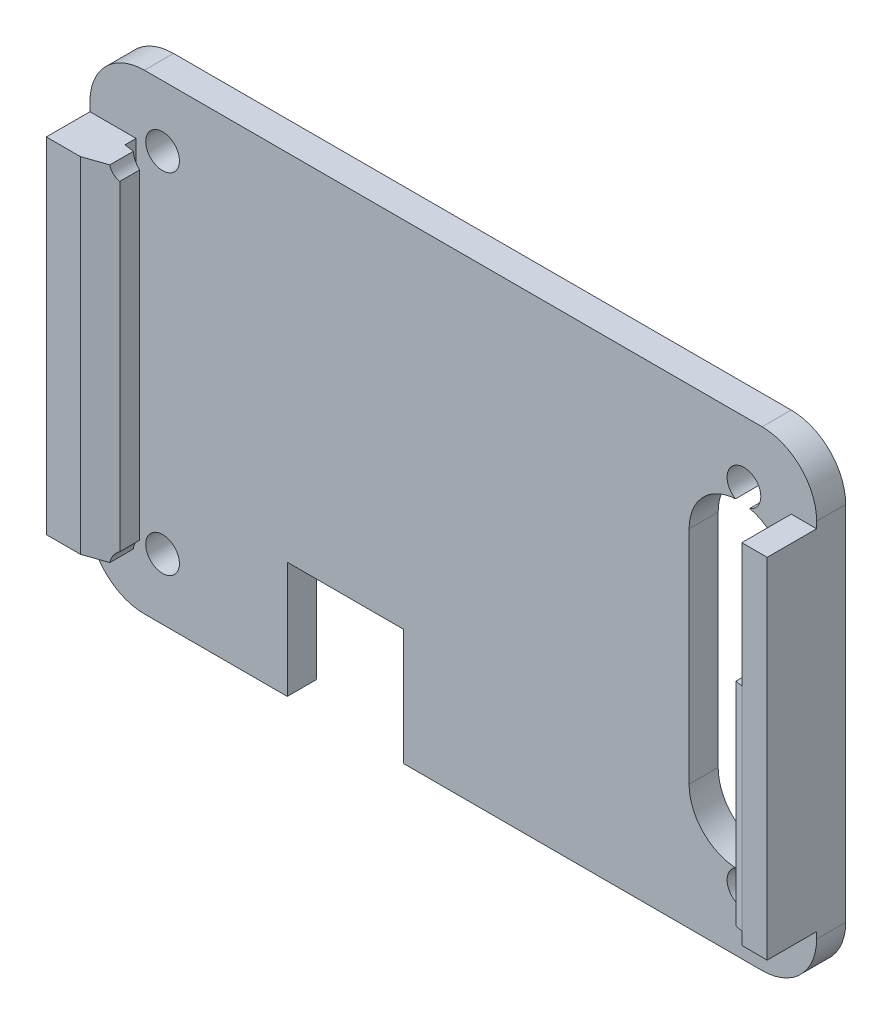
ISO-10303-21;
HEADER;
FILE_DESCRIPTION(('STEP AP214'),'2;1');
FILE_NAME('part.step','',(''),(''),'','','');
FILE_SCHEMA(('AUTOMOTIVE_DESIGN { 1 0 10303 214 1 1 1 1 }'));
ENDSEC;
DATA;
#1=APPLICATION_CONTEXT('core data for automotive mechanical design processes');
#2=APPLICATION_PROTOCOL_DEFINITION('international standard','automotive_design',2000,#1);
#3=PRODUCT_CONTEXT('',#1,'mechanical');
#4=PRODUCT('Part','Part','',(#3));
#5=PRODUCT_RELATED_PRODUCT_CATEGORY('part','',(#4));
#6=PRODUCT_DEFINITION_FORMATION('','',#4);
#7=PRODUCT_DEFINITION_CONTEXT('part definition',#1,'design');
#8=PRODUCT_DEFINITION('design','',#6,#7);
#9=PRODUCT_DEFINITION_SHAPE('','',#8);
#10=(LENGTH_UNIT() NAMED_UNIT(*) SI_UNIT(.MILLI.,.METRE.));
#11=(NAMED_UNIT(*) PLANE_ANGLE_UNIT() SI_UNIT($,.RADIAN.));
#12=(NAMED_UNIT(*) SI_UNIT($,.STERADIAN.) SOLID_ANGLE_UNIT());
#13=UNCERTAINTY_MEASURE_WITH_UNIT(LENGTH_MEASURE(1.E-05),#10,'distance_accuracy_value','');
#14=(GEOMETRIC_REPRESENTATION_CONTEXT(3) GLOBAL_UNCERTAINTY_ASSIGNED_CONTEXT((#13)) GLOBAL_UNIT_ASSIGNED_CONTEXT((#10,
#11,#12)) REPRESENTATION_CONTEXT('',''));
#15=CARTESIAN_POINT('',(0.,0.,0.));
#16=DIRECTION('',(0.,0.,1.));
#17=DIRECTION('',(1.,0.,0.));
#18=AXIS2_PLACEMENT_3D('',#15,#16,#17);
#19=CARTESIAN_POINT('',(24.9129363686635,9.66443864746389,4.318));
#20=DIRECTION('',(0.,0.,-1.));
#21=DIRECTION('',(-1.,0.,0.));
#22=AXIS2_PLACEMENT_3D('',#19,#20,#21);
#23=CYLINDRICAL_SURFACE('',#22,4.30609592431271);
#24=CARTESIAN_POINT('',(24.9129363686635,9.66443864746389,2.54));
#25=DIRECTION('',(0.,0.,-1.));
#26=DIRECTION('',(-1.,0.,0.));
#27=AXIS2_PLACEMENT_3D('',#24,#25,#26);
#28=CIRCLE('',#27,4.30609592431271);
#29=CARTESIAN_POINT('',(25.9027333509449,13.8552338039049,2.54));
#30=VERTEX_POINT('',#29);
#31=CARTESIAN_POINT('',(29.2190322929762,9.66443864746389,2.54));
#32=VERTEX_POINT('',#31);
#33=EDGE_CURVE('E295',#30,#32,#28,.T.);
#34=ORIENTED_EDGE('',*,*,#33,.F.);
#35=DIRECTION('',(0.,0.,-1.));
#36=VECTOR('',#35,1.);
#37=CARTESIAN_POINT('',(25.9027333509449,13.8552338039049,3.429));
#38=LINE('',#37,#36);
#39=CARTESIAN_POINT('',(25.9027333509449,13.8552338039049,0.));
#40=VERTEX_POINT('',#39);
#41=EDGE_CURVE('E13',#30,#40,#38,.T.);
#42=ORIENTED_EDGE('',*,*,#41,.T.);
#43=CARTESIAN_POINT('',(24.9129363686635,9.66443864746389,0.));
#44=DIRECTION('',(0.,0.,-1.));
#45=DIRECTION('',(-1.,0.,0.));
#46=AXIS2_PLACEMENT_3D('',#43,#44,#45);
#47=CIRCLE('',#46,4.30609592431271);
#48=CARTESIAN_POINT('',(29.2190322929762,9.66443864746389,0.));
#49=VERTEX_POINT('',#48);
#50=EDGE_CURVE('E293',#40,#49,#47,.T.);
#51=ORIENTED_EDGE('',*,*,#50,.T.);
#52=DIRECTION('',(0.,0.,-1.));
#53=VECTOR('',#52,1.);
#54=CARTESIAN_POINT('',(29.2190322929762,9.66443864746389,4.318));
#55=LINE('',#54,#53);
#56=EDGE_CURVE('E318',#32,#49,#55,.T.);
#57=ORIENTED_EDGE('',*,*,#56,.F.);
#58=EDGE_LOOP('',(#34,#42,#51,#57));
#59=FACE_BOUND('',#58,.T.);
#60=ADVANCED_FACE('F46',(#59),#23,.F.);
#61=CARTESIAN_POINT('',(24.9129363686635,-9.66443864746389,4.318));
#62=DIRECTION('',(0.,0.,-1.));
#63=DIRECTION('',(-1.,0.,0.));
#64=AXIS2_PLACEMENT_3D('',#61,#62,#63);
#65=CYLINDRICAL_SURFACE('',#64,4.30609592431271);
#66=CARTESIAN_POINT('',(24.9129363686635,-9.66443864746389,2.54));
#67=DIRECTION('',(0.,0.,-1.));
#68=DIRECTION('',(-1.,0.,0.));
#69=AXIS2_PLACEMENT_3D('',#66,#67,#68);
#70=CIRCLE('',#69,4.30609592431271);
#71=CARTESIAN_POINT('',(24.6647760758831,-13.9633778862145,2.54));
#72=VERTEX_POINT('',#71);
#73=CARTESIAN_POINT('',(20.6068404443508,-9.66443864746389,2.54));
#74=VERTEX_POINT('',#73);
#75=EDGE_CURVE('E330',#72,#74,#70,.T.);
#76=ORIENTED_EDGE('',*,*,#75,.F.);
#77=DIRECTION('',(0.,0.,-1.));
#78=VECTOR('',#77,1.);
#79=CARTESIAN_POINT('',(24.6647760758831,-13.9633778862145,3.429));
#80=LINE('',#79,#78);
#81=CARTESIAN_POINT('',(24.6647760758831,-13.9633778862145,0.));
#82=VERTEX_POINT('',#81);
#83=EDGE_CURVE('E465',#72,#82,#80,.T.);
#84=ORIENTED_EDGE('',*,*,#83,.T.);
#85=CARTESIAN_POINT('',(24.9129363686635,-9.66443864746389,0.));
#86=DIRECTION('',(0.,0.,-1.));
#87=DIRECTION('',(-1.,0.,0.));
#88=AXIS2_PLACEMENT_3D('',#85,#86,#87);
#89=CIRCLE('',#88,4.30609592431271);
#90=CARTESIAN_POINT('',(20.6068404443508,-9.66443864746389,0.));
#91=VERTEX_POINT('',#90);
#92=EDGE_CURVE('E311',#82,#91,#89,.T.);
#93=ORIENTED_EDGE('',*,*,#92,.T.);
#94=DIRECTION('',(0.,0.,-1.));
#95=VECTOR('',#94,1.);
#96=CARTESIAN_POINT('',(20.6068404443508,-9.66443864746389,4.318));
#97=LINE('',#96,#95);
#98=EDGE_CURVE('E322',#74,#91,#97,.T.);
#99=ORIENTED_EDGE('',*,*,#98,.F.);
#100=EDGE_LOOP('',(#76,#84,#93,#99));
#101=FACE_BOUND('',#100,.T.);
#102=ADVANCED_FACE('F486',(#101),#65,.F.);
#103=CARTESIAN_POINT('',(0.,0.,2.54));
#104=DIRECTION('',(0.,0.,-1.));
#105=DIRECTION('',(-1.,0.,0.));
#106=AXIS2_PLACEMENT_3D('',#103,#104,#105);
#107=PLANE('',#106);
#108=CARTESIAN_POINT('',(-25.4,-15.24,2.54));
#109=DIRECTION('',(0.,0.,-1.));
#110=DIRECTION('',(-1.,0.,0.));
#111=AXIS2_PLACEMENT_3D('',#108,#109,#110);
#112=CIRCLE('',#111,1.47319999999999);
#113=CARTESIAN_POINT('',(-26.8732,-15.24,2.54));
#114=VERTEX_POINT('',#113);
#115=EDGE_CURVE('E468',#114,#114,#112,.T.);
#116=ORIENTED_EDGE('',*,*,#115,.T.);
#117=EDGE_LOOP('',(#116));
#118=FACE_BOUND('',#117,.T.);
#119=CARTESIAN_POINT('',(-25.4,15.24,2.54));
#120=DIRECTION('',(0.,0.,-1.));
#121=DIRECTION('',(-1.,0.,0.));
#122=AXIS2_PLACEMENT_3D('',#119,#120,#121);
#123=CIRCLE('',#122,1.47319999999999);
#124=CARTESIAN_POINT('',(-26.8732,15.24,2.54));
#125=VERTEX_POINT('',#124);
#126=EDGE_CURVE('E458',#125,#125,#123,.T.);
#127=ORIENTED_EDGE('',*,*,#126,.T.);
#128=EDGE_LOOP('',(#127));
#129=FACE_BOUND('',#128,.T.);
#130=CARTESIAN_POINT('',(20.6068404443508,9.66443864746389,2.54));
#131=VERTEX_POINT('',#130);
#132=CARTESIAN_POINT('',(24.6647760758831,13.9633778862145,2.54));
#133=VERTEX_POINT('',#132);
#134=EDGE_CURVE('E337',#131,#133,#28,.T.);
#135=ORIENTED_EDGE('',*,*,#134,.T.);
#136=CARTESIAN_POINT('',(25.4,15.24,2.54));
#137=DIRECTION('',(0.,0.,-1.));
#138=DIRECTION('',(-1.,0.,0.));
#139=AXIS2_PLACEMENT_3D('',#136,#137,#138);
#140=CIRCLE('',#139,1.47319999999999);
#141=EDGE_CURVE('E61',#133,#30,#140,.T.);
#142=ORIENTED_EDGE('',*,*,#141,.T.);
#143=ORIENTED_EDGE('',*,*,#33,.T.);
#144=DIRECTION('',(0.,-1.,0.));
#145=VECTOR('',#144,1.);
#146=CARTESIAN_POINT('',(29.2190322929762,0.,2.54));
#147=LINE('',#146,#145);
#148=CARTESIAN_POINT('',(29.2190322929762,-9.66443864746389,2.54));
#149=VERTEX_POINT('',#148);
#150=EDGE_CURVE('E321',#32,#149,#147,.T.);
#151=ORIENTED_EDGE('',*,*,#150,.T.);
#152=CARTESIAN_POINT('',(25.9027333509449,-13.8552338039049,2.54));
#153=VERTEX_POINT('',#152);
#154=EDGE_CURVE('E331',#149,#153,#70,.T.);
#155=ORIENTED_EDGE('',*,*,#154,.T.);
#156=CARTESIAN_POINT('',(25.4,-15.24,2.54));
#157=DIRECTION('',(0.,0.,-1.));
#158=DIRECTION('',(-1.,0.,0.));
#159=AXIS2_PLACEMENT_3D('',#156,#157,#158);
#160=CIRCLE('',#159,1.47319999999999);
#161=EDGE_CURVE('E491',#153,#72,#160,.T.);
#162=ORIENTED_EDGE('',*,*,#161,.T.);
#163=ORIENTED_EDGE('',*,*,#75,.T.);
#164=DIRECTION('',(0.,1.,0.));
#165=VECTOR('',#164,1.);
#166=CARTESIAN_POINT('',(20.6068404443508,0.,2.54));
#167=LINE('',#166,#165);
#168=EDGE_CURVE('E334',#74,#131,#167,.T.);
#169=ORIENTED_EDGE('',*,*,#168,.T.);
#170=EDGE_LOOP('',(#135,#142,#143,#151,#155,#162,#163,#169));
#171=FACE_BOUND('',#170,.T.);
#172=DIRECTION('',(1.,0.,0.));
#173=VECTOR('',#172,1.);
#174=CARTESIAN_POINT('',(31.75,-15.24,2.54));
#175=LINE('',#174,#173);
#176=CARTESIAN_POINT('',(29.5313256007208,-15.24,2.54));
#177=VERTEX_POINT('',#176);
#178=CARTESIAN_POINT('',(31.75,-15.24,2.54));
#179=VERTEX_POINT('',#178);
#180=EDGE_CURVE('E545',#177,#179,#175,.T.);
#181=ORIENTED_EDGE('',*,*,#180,.F.);
#182=DIRECTION('',(0.,-1.,0.));
#183=VECTOR('',#182,1.);
#184=CARTESIAN_POINT('',(29.5313256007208,-15.24,2.54));
#185=LINE('',#184,#183);
#186=CARTESIAN_POINT('',(29.5313256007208,15.24,2.54));
#187=VERTEX_POINT('',#186);
#188=EDGE_CURVE('E550',#187,#177,#185,.T.);
#189=ORIENTED_EDGE('',*,*,#188,.F.);
#190=DIRECTION('',(-1.,0.,0.));
#191=VECTOR('',#190,1.);
#192=CARTESIAN_POINT('',(29.5313256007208,15.24,2.54));
#193=LINE('',#192,#191);
#194=CARTESIAN_POINT('',(31.75,15.24,2.54));
#195=VERTEX_POINT('',#194);
#196=EDGE_CURVE('E561',#195,#187,#193,.T.);
#197=ORIENTED_EDGE('',*,*,#196,.F.);
#198=DIRECTION('',(0.,1.,0.));
#199=VECTOR('',#198,1.);
#200=CARTESIAN_POINT('',(31.75,-20.574,2.54));
#201=LINE('',#200,#199);
#202=CARTESIAN_POINT('',(31.75,15.8115,2.54));
#203=VERTEX_POINT('',#202);
#204=EDGE_CURVE('E578',#195,#203,#201,.T.);
#205=ORIENTED_EDGE('',*,*,#204,.T.);
#206=CARTESIAN_POINT('',(26.9875,15.8115,2.54));
#207=DIRECTION('',(0.,0.,-1.));
#208=DIRECTION('',(-1.,0.,0.));
#209=AXIS2_PLACEMENT_3D('',#206,#207,#208);
#210=CIRCLE('',#209,4.7625);
#211=CARTESIAN_POINT('',(26.9875,20.574,2.54));
#212=VERTEX_POINT('',#211);
#213=EDGE_CURVE('E433',#203,#212,#210,.F.);
#214=ORIENTED_EDGE('',*,*,#213,.T.);
#215=DIRECTION('',(-1.,0.,0.));
#216=VECTOR('',#215,1.);
#217=CARTESIAN_POINT('',(-31.75,20.574,2.54));
#218=LINE('',#217,#216);
#219=CARTESIAN_POINT('',(-26.9875,20.574,2.54));
#220=VERTEX_POINT('',#219);
#221=EDGE_CURVE('E402',#212,#220,#218,.T.);
#222=ORIENTED_EDGE('',*,*,#221,.T.);
#223=CARTESIAN_POINT('',(-26.9875,15.8115,2.54));
#224=DIRECTION('',(0.,0.,-1.));
#225=DIRECTION('',(-1.,0.,0.));
#226=AXIS2_PLACEMENT_3D('',#223,#224,#225);
#227=CIRCLE('',#226,4.7625);
#228=CARTESIAN_POINT('',(-31.75,15.8115,2.54));
#229=VERTEX_POINT('',#228);
#230=EDGE_CURVE('E431',#220,#229,#227,.F.);
#231=ORIENTED_EDGE('',*,*,#230,.T.);
#232=DIRECTION('',(0.,-1.,0.));
#233=VECTOR('',#232,1.);
#234=CARTESIAN_POINT('',(-31.75,-20.574,2.54));
#235=LINE('',#234,#233);
#236=CARTESIAN_POINT('',(-31.75,15.0495,2.54));
#237=VERTEX_POINT('',#236);
#238=EDGE_CURVE('E423',#229,#237,#235,.T.);
#239=ORIENTED_EDGE('',*,*,#238,.T.);
#240=DIRECTION('',(-1.,0.,0.));
#241=VECTOR('',#240,1.);
#242=CARTESIAN_POINT('',(-31.75,15.0495,2.54));
#243=LINE('',#242,#241);
#244=CARTESIAN_POINT('',(-27.7114,15.0495,2.54));
#245=VERTEX_POINT('',#244);
#246=EDGE_CURVE('E382',#245,#237,#243,.T.);
#247=ORIENTED_EDGE('',*,*,#246,.F.);
#248=DIRECTION('',(0.,1.,0.));
#249=VECTOR('',#248,1.);
#250=CARTESIAN_POINT('',(-27.7114,-20.574025,2.54));
#251=LINE('',#250,#249);
#252=CARTESIAN_POINT('',(-27.7114,-15.0495,2.54));
#253=VERTEX_POINT('',#252);
#254=EDGE_CURVE('E364',#253,#245,#251,.T.);
#255=ORIENTED_EDGE('',*,*,#254,.F.);
#256=DIRECTION('',(1.,0.,0.));
#257=VECTOR('',#256,1.);
#258=CARTESIAN_POINT('',(-31.75,-15.0495,2.54));
#259=LINE('',#258,#257);
#260=CARTESIAN_POINT('',(-31.75,-15.0495,2.54));
#261=VERTEX_POINT('',#260);
#262=EDGE_CURVE('E377',#261,#253,#259,.T.);
#263=ORIENTED_EDGE('',*,*,#262,.F.);
#264=CARTESIAN_POINT('',(-31.75,-15.8115,2.54));
#265=VERTEX_POINT('',#264);
#266=EDGE_CURVE('E426',#261,#265,#235,.T.);
#267=ORIENTED_EDGE('',*,*,#266,.T.);
#268=CARTESIAN_POINT('',(-26.9875,-15.8115,2.54));
#269=DIRECTION('',(0.,0.,-1.));
#270=DIRECTION('',(-1.,0.,0.));
#271=AXIS2_PLACEMENT_3D('',#268,#269,#270);
#272=CIRCLE('',#271,4.7625);
#273=CARTESIAN_POINT('',(-26.9875,-20.574,2.54));
#274=VERTEX_POINT('',#273);
#275=EDGE_CURVE('E437',#265,#274,#272,.F.);
#276=ORIENTED_EDGE('',*,*,#275,.T.);
#277=DIRECTION('',(1.,0.,0.));
#278=VECTOR('',#277,1.);
#279=CARTESIAN_POINT('',(-31.75,-20.574,2.54));
#280=LINE('',#279,#278);
#281=CARTESIAN_POINT('',(-14.5034,-20.574,2.54));
#282=VERTEX_POINT('',#281);
#283=EDGE_CURVE('E583',#274,#282,#280,.T.);
#284=ORIENTED_EDGE('',*,*,#283,.T.);
#285=DIRECTION('',(0.,-1.,0.));
#286=VECTOR('',#285,1.);
#287=CARTESIAN_POINT('',(-14.5034,-20.574,2.54));
#288=LINE('',#287,#286);
#289=CARTESIAN_POINT('',(-14.5034,-10.414,2.54));
#290=VERTEX_POINT('',#289);
#291=EDGE_CURVE('E340',#290,#282,#288,.T.);
#292=ORIENTED_EDGE('',*,*,#291,.F.);
#293=DIRECTION('',(-1.,0.,0.));
#294=VECTOR('',#293,1.);
#295=CARTESIAN_POINT('',(-14.5034,-10.414,2.54));
#296=LINE('',#295,#294);
#297=CARTESIAN_POINT('',(-4.3434,-10.414,2.54));
#298=VERTEX_POINT('',#297);
#299=EDGE_CURVE('E345',#298,#290,#296,.T.);
#300=ORIENTED_EDGE('',*,*,#299,.F.);
#301=DIRECTION('',(0.,1.,0.));
#302=VECTOR('',#301,1.);
#303=CARTESIAN_POINT('',(-4.3434,-20.574,2.54));
#304=LINE('',#303,#302);
#305=CARTESIAN_POINT('',(-4.3434,-20.574,2.54));
#306=VERTEX_POINT('',#305);
#307=EDGE_CURVE('E342',#306,#298,#304,.T.);
#308=ORIENTED_EDGE('',*,*,#307,.F.);
#309=CARTESIAN_POINT('',(26.9875,-20.574,2.54));
#310=VERTEX_POINT('',#309);
#311=EDGE_CURVE('E425',#306,#310,#280,.T.);
#312=ORIENTED_EDGE('',*,*,#311,.T.);
#313=CARTESIAN_POINT('',(26.9875,-15.8115,2.54));
#314=DIRECTION('',(0.,0.,-1.));
#315=DIRECTION('',(-1.,0.,0.));
#316=AXIS2_PLACEMENT_3D('',#313,#314,#315);
#317=CIRCLE('',#316,4.7625);
#318=CARTESIAN_POINT('',(31.75,-15.8115,2.54));
#319=VERTEX_POINT('',#318);
#320=EDGE_CURVE('E435',#310,#319,#317,.F.);
#321=ORIENTED_EDGE('',*,*,#320,.T.);
#322=EDGE_CURVE('E582',#319,#179,#201,.T.);
#323=ORIENTED_EDGE('',*,*,#322,.T.);
#324=EDGE_LOOP('',(#181,#189,#197,#205,#214,#222,#231,#239,#247,#255,#263,#267,#276,#284,#292,
#300,#308,#312,#321,#323));
#325=FACE_BOUND('',#324,.T.);
#326=ADVANCED_FACE('F476',(#118,#129,#171,#325),#107,.F.);
#327=CARTESIAN_POINT('',(-31.75,-20.574,2.54));
#328=DIRECTION('',(0.,1.,0.));
#329=DIRECTION('',(0.,0.,1.));
#330=AXIS2_PLACEMENT_3D('',#327,#328,#329);
#331=PLANE('',#330);
#332=DIRECTION('',(1.,0.,0.));
#333=VECTOR('',#332,1.);
#334=CARTESIAN_POINT('',(-31.75,-20.574,0.));
#335=LINE('',#334,#333);
#336=CARTESIAN_POINT('',(-26.9875,-20.574,0.));
#337=VERTEX_POINT('',#336);
#338=CARTESIAN_POINT('',(-14.5034,-20.574,0.));
#339=VERTEX_POINT('',#338);
#340=EDGE_CURVE('E614',#337,#339,#335,.T.);
#341=ORIENTED_EDGE('',*,*,#340,.T.);
#342=DIRECTION('',(0.,0.,1.));
#343=VECTOR('',#342,1.);
#344=CARTESIAN_POINT('',(-14.5034,-20.574,-1.778));
#345=LINE('',#344,#343);
#346=EDGE_CURVE('E348',#339,#282,#345,.T.);
#347=ORIENTED_EDGE('',*,*,#346,.T.);
#348=ORIENTED_EDGE('',*,*,#283,.F.);
#349=DIRECTION('',(0.,0.,-1.));
#350=VECTOR('',#349,1.);
#351=CARTESIAN_POINT('',(-26.9875,-20.574,2.54));
#352=LINE('',#351,#350);
#353=EDGE_CURVE('E410',#274,#337,#352,.T.);
#354=ORIENTED_EDGE('',*,*,#353,.T.);
#355=EDGE_LOOP('',(#341,#347,#348,#354));
#356=FACE_BOUND('',#355,.T.);
#357=ADVANCED_FACE('F675',(#356),#331,.F.);
#358=CARTESIAN_POINT('',(-31.75,-20.574,2.54));
#359=DIRECTION('',(1.,0.,0.));
#360=DIRECTION('',(0.,0.,-1.));
#361=AXIS2_PLACEMENT_3D('',#358,#359,#360);
#362=PLANE('',#361);
#363=DIRECTION('',(0.,-1.,0.));
#364=VECTOR('',#363,1.);
#365=CARTESIAN_POINT('',(-31.75,-20.574,0.));
#366=LINE('',#365,#364);
#367=CARTESIAN_POINT('',(-31.75,15.8115,0.));
#368=VERTEX_POINT('',#367);
#369=CARTESIAN_POINT('',(-31.75,-15.8115,0.));
#370=VERTEX_POINT('',#369);
#371=EDGE_CURVE('E631',#368,#370,#366,.T.);
#372=ORIENTED_EDGE('',*,*,#371,.T.);
#373=DIRECTION('',(0.,0.,-1.));
#374=VECTOR('',#373,1.);
#375=CARTESIAN_POINT('',(-31.75,-15.8115,2.54));
#376=LINE('',#375,#374);
#377=EDGE_CURVE('E429',#370,#265,#376,.F.);
#378=ORIENTED_EDGE('',*,*,#377,.T.);
#379=ORIENTED_EDGE('',*,*,#266,.F.);
#380=DIRECTION('',(0.,0.,-1.));
#381=VECTOR('',#380,1.);
#382=CARTESIAN_POINT('',(-31.75,-15.0495,6.35));
#383=LINE('',#382,#381);
#384=CARTESIAN_POINT('',(-31.75,-15.0495,6.35));
#385=VERTEX_POINT('',#384);
#386=EDGE_CURVE('E628',#385,#261,#383,.T.);
#387=ORIENTED_EDGE('',*,*,#386,.F.);
#388=DIRECTION('',(0.,-1.,0.));
#389=VECTOR('',#388,1.);
#390=CARTESIAN_POINT('',(-31.75,15.0495,6.35));
#391=LINE('',#390,#389);
#392=CARTESIAN_POINT('',(-31.75,15.0495,6.35));
#393=VERTEX_POINT('',#392);
#394=EDGE_CURVE('E378',#393,#385,#391,.T.);
#395=ORIENTED_EDGE('',*,*,#394,.F.);
#396=DIRECTION('',(0.,0.,-1.));
#397=VECTOR('',#396,1.);
#398=CARTESIAN_POINT('',(-31.75,15.0495,6.35));
#399=LINE('',#398,#397);
#400=EDGE_CURVE('E387',#393,#237,#399,.T.);
#401=ORIENTED_EDGE('',*,*,#400,.T.);
#402=ORIENTED_EDGE('',*,*,#238,.F.);
#403=DIRECTION('',(0.,0.,-1.));
#404=VECTOR('',#403,1.);
#405=CARTESIAN_POINT('',(-31.75,15.8115,2.54));
#406=LINE('',#405,#404);
#407=EDGE_CURVE('E422',#229,#368,#406,.T.);
#408=ORIENTED_EDGE('',*,*,#407,.T.);
#409=EDGE_LOOP('',(#372,#378,#379,#387,#395,#401,#402,#408));
#410=FACE_BOUND('',#409,.T.);
#411=ADVANCED_FACE('F639',(#410),#362,.F.);
#412=ORIENTED_EDGE('',*,*,#311,.F.);
#413=DIRECTION('',(0.,0.,1.));
#414=VECTOR('',#413,1.);
#415=CARTESIAN_POINT('',(-4.3434,-20.574,-1.778));
#416=LINE('',#415,#414);
#417=CARTESIAN_POINT('',(-4.3434,-20.574,0.));
#418=VERTEX_POINT('',#417);
#419=EDGE_CURVE('E354',#418,#306,#416,.T.);
#420=ORIENTED_EDGE('',*,*,#419,.F.);
#421=CARTESIAN_POINT('',(26.9875,-20.574,0.));
#422=VERTEX_POINT('',#421);
#423=EDGE_CURVE('E610',#418,#422,#335,.T.);
#424=ORIENTED_EDGE('',*,*,#423,.T.);
#425=DIRECTION('',(0.,0.,-1.));
#426=VECTOR('',#425,1.);
#427=CARTESIAN_POINT('',(26.9875,-20.574,2.54));
#428=LINE('',#427,#426);
#429=EDGE_CURVE('E407',#422,#310,#428,.F.);
#430=ORIENTED_EDGE('',*,*,#429,.T.);
#431=EDGE_LOOP('',(#412,#420,#424,#430));
#432=FACE_BOUND('',#431,.T.);
#433=ADVANCED_FACE('F665',(#432),#331,.F.);
#434=CARTESIAN_POINT('',(31.75,-20.574,2.54));
#435=DIRECTION('',(-1.,0.,0.));
#436=DIRECTION('',(0.,0.,1.));
#437=AXIS2_PLACEMENT_3D('',#434,#435,#436);
#438=PLANE('',#437);
#439=DIRECTION('',(0.,0.,-1.));
#440=VECTOR('',#439,1.);
#441=CARTESIAN_POINT('',(31.75,15.24,6.858));
#442=LINE('',#441,#440);
#443=CARTESIAN_POINT('',(31.75,15.24,6.858));
#444=VERTEX_POINT('',#443);
#445=EDGE_CURVE('E306',#444,#195,#442,.T.);
#446=ORIENTED_EDGE('',*,*,#445,.F.);
#447=DIRECTION('',(0.,1.,0.));
#448=VECTOR('',#447,1.);
#449=CARTESIAN_POINT('',(31.75,15.24,6.858));
#450=LINE('',#449,#448);
#451=CARTESIAN_POINT('',(31.75,-15.24,6.858));
#452=VERTEX_POINT('',#451);
#453=EDGE_CURVE('E549',#452,#444,#450,.T.);
#454=ORIENTED_EDGE('',*,*,#453,.F.);
#455=DIRECTION('',(0.,0.,-1.));
#456=VECTOR('',#455,1.);
#457=CARTESIAN_POINT('',(31.75,-15.24,6.858));
#458=LINE('',#457,#456);
#459=EDGE_CURVE('E303',#452,#179,#458,.T.);
#460=ORIENTED_EDGE('',*,*,#459,.T.);
#461=ORIENTED_EDGE('',*,*,#322,.F.);
#462=DIRECTION('',(0.,0.,-1.));
#463=VECTOR('',#462,1.);
#464=CARTESIAN_POINT('',(31.75,-15.8115,2.54));
#465=LINE('',#464,#463);
#466=CARTESIAN_POINT('',(31.75,-15.8115,0.));
#467=VERTEX_POINT('',#466);
#468=EDGE_CURVE('E442',#319,#467,#465,.T.);
#469=ORIENTED_EDGE('',*,*,#468,.T.);
#470=DIRECTION('',(0.,1.,0.));
#471=VECTOR('',#470,1.);
#472=CARTESIAN_POINT('',(31.75,-20.574,0.));
#473=LINE('',#472,#471);
#474=CARTESIAN_POINT('',(31.75,15.8115,0.));
#475=VERTEX_POINT('',#474);
#476=EDGE_CURVE('E611',#467,#475,#473,.T.);
#477=ORIENTED_EDGE('',*,*,#476,.T.);
#478=DIRECTION('',(0.,0.,-1.));
#479=VECTOR('',#478,1.);
#480=CARTESIAN_POINT('',(31.75,15.8115,2.54));
#481=LINE('',#480,#479);
#482=EDGE_CURVE('E439',#475,#203,#481,.F.);
#483=ORIENTED_EDGE('',*,*,#482,.T.);
#484=ORIENTED_EDGE('',*,*,#204,.F.);
#485=EDGE_LOOP('',(#446,#454,#460,#461,#469,#477,#483,#484));
#486=FACE_BOUND('',#485,.T.);
#487=ADVANCED_FACE('F577',(#486),#438,.F.);
#488=CARTESIAN_POINT('',(-31.75,20.574,2.54));
#489=DIRECTION('',(0.,-1.,0.));
#490=DIRECTION('',(0.,0.,-1.));
#491=AXIS2_PLACEMENT_3D('',#488,#489,#490);
#492=PLANE('',#491);
#493=ORIENTED_EDGE('',*,*,#221,.F.);
#494=DIRECTION('',(0.,0.,-1.));
#495=VECTOR('',#494,1.);
#496=CARTESIAN_POINT('',(26.9875,20.574,2.54));
#497=LINE('',#496,#495);
#498=CARTESIAN_POINT('',(26.9875,20.574,0.));
#499=VERTEX_POINT('',#498);
#500=EDGE_CURVE('E447',#212,#499,#497,.T.);
#501=ORIENTED_EDGE('',*,*,#500,.T.);
#502=DIRECTION('',(-1.,0.,0.));
#503=VECTOR('',#502,1.);
#504=CARTESIAN_POINT('',(-31.75,20.574,0.));
#505=LINE('',#504,#503);
#506=CARTESIAN_POINT('',(-26.9875,20.574,0.));
#507=VERTEX_POINT('',#506);
#508=EDGE_CURVE('E613',#499,#507,#505,.T.);
#509=ORIENTED_EDGE('',*,*,#508,.T.);
#510=DIRECTION('',(0.,0.,-1.));
#511=VECTOR('',#510,1.);
#512=CARTESIAN_POINT('',(-26.9875,20.574,2.54));
#513=LINE('',#512,#511);
#514=EDGE_CURVE('E445',#507,#220,#513,.F.);
#515=ORIENTED_EDGE('',*,*,#514,.T.);
#516=EDGE_LOOP('',(#493,#501,#509,#515));
#517=FACE_BOUND('',#516,.T.);
#518=ADVANCED_FACE('F754',(#517),#492,.F.);
#519=CARTESIAN_POINT('',(0.,0.,0.));
#520=DIRECTION('',(0.,0.,-1.));
#521=DIRECTION('',(-1.,0.,0.));
#522=AXIS2_PLACEMENT_3D('',#519,#520,#521);
#523=PLANE('',#522);
#524=CARTESIAN_POINT('',(25.4,15.24,0.));
#525=DIRECTION('',(0.,0.,-1.));
#526=DIRECTION('',(-1.,0.,0.));
#527=AXIS2_PLACEMENT_3D('',#524,#525,#526);
#528=CIRCLE('',#527,1.47319999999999);
#529=CARTESIAN_POINT('',(24.6647760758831,13.9633778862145,0.));
#530=VERTEX_POINT('',#529);
#531=EDGE_CURVE('E283',#530,#40,#528,.T.);
#532=ORIENTED_EDGE('',*,*,#531,.F.);
#533=CARTESIAN_POINT('',(20.6068404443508,9.66443864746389,0.));
#534=VERTEX_POINT('',#533);
#535=EDGE_CURVE('E302',#534,#530,#47,.T.);
#536=ORIENTED_EDGE('',*,*,#535,.F.);
#537=DIRECTION('',(0.,1.,0.));
#538=VECTOR('',#537,1.);
#539=CARTESIAN_POINT('',(20.6068404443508,9.66443864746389,0.));
#540=LINE('',#539,#538);
#541=EDGE_CURVE('E315',#91,#534,#540,.T.);
#542=ORIENTED_EDGE('',*,*,#541,.F.);
#543=ORIENTED_EDGE('',*,*,#92,.F.);
#544=CARTESIAN_POINT('',(25.4,-15.24,0.));
#545=DIRECTION('',(0.,0.,-1.));
#546=DIRECTION('',(-1.,0.,0.));
#547=AXIS2_PLACEMENT_3D('',#544,#545,#546);
#548=CIRCLE('',#547,1.47319999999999);
#549=CARTESIAN_POINT('',(25.9027333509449,-13.8552338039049,0.));
#550=VERTEX_POINT('',#549);
#551=EDGE_CURVE('E489',#550,#82,#548,.T.);
#552=ORIENTED_EDGE('',*,*,#551,.F.);
#553=CARTESIAN_POINT('',(29.2190322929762,-9.66443864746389,0.));
#554=VERTEX_POINT('',#553);
#555=EDGE_CURVE('E312',#554,#550,#89,.T.);
#556=ORIENTED_EDGE('',*,*,#555,.F.);
#557=DIRECTION('',(0.,-1.,0.));
#558=VECTOR('',#557,1.);
#559=CARTESIAN_POINT('',(29.2190322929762,9.66443864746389,0.));
#560=LINE('',#559,#558);
#561=EDGE_CURVE('E301',#49,#554,#560,.T.);
#562=ORIENTED_EDGE('',*,*,#561,.F.);
#563=ORIENTED_EDGE('',*,*,#50,.F.);
#564=EDGE_LOOP('',(#532,#536,#542,#543,#552,#556,#562,#563));
#565=FACE_BOUND('',#564,.T.);
#566=CARTESIAN_POINT('',(-25.4,-15.24,0.));
#567=DIRECTION('',(0.,0.,-1.));
#568=DIRECTION('',(-1.,0.,0.));
#569=AXIS2_PLACEMENT_3D('',#566,#567,#568);
#570=CIRCLE('',#569,1.47319999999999);
#571=CARTESIAN_POINT('',(-26.8732,-15.24,0.));
#572=VERTEX_POINT('',#571);
#573=EDGE_CURVE('E471',#572,#572,#570,.T.);
#574=ORIENTED_EDGE('',*,*,#573,.F.);
#575=EDGE_LOOP('',(#574));
#576=FACE_BOUND('',#575,.T.);
#577=CARTESIAN_POINT('',(-25.4,15.24,0.));
#578=DIRECTION('',(0.,0.,-1.));
#579=DIRECTION('',(-1.,0.,0.));
#580=AXIS2_PLACEMENT_3D('',#577,#578,#579);
#581=CIRCLE('',#580,1.47319999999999);
#582=CARTESIAN_POINT('',(-26.8732,15.24,0.));
#583=VERTEX_POINT('',#582);
#584=EDGE_CURVE('E462',#583,#583,#581,.T.);
#585=ORIENTED_EDGE('',*,*,#584,.F.);
#586=EDGE_LOOP('',(#585));
#587=FACE_BOUND('',#586,.T.);
#588=DIRECTION('',(0.,1.,0.));
#589=VECTOR('',#588,1.);
#590=CARTESIAN_POINT('',(-14.5034,0.,0.));
#591=LINE('',#590,#589);
#592=CARTESIAN_POINT('',(-14.5034,-10.414,0.));
#593=VERTEX_POINT('',#592);
#594=EDGE_CURVE('E455',#339,#593,#591,.T.);
#595=ORIENTED_EDGE('',*,*,#594,.F.);
#596=ORIENTED_EDGE('',*,*,#340,.F.);
#597=CARTESIAN_POINT('',(-26.9875,-15.8115,0.));
#598=DIRECTION('',(0.,0.,-1.));
#599=DIRECTION('',(-1.,0.,0.));
#600=AXIS2_PLACEMENT_3D('',#597,#598,#599);
#601=CIRCLE('',#600,4.7625);
#602=EDGE_CURVE('E420',#337,#370,#601,.T.);
#603=ORIENTED_EDGE('',*,*,#602,.T.);
#604=ORIENTED_EDGE('',*,*,#371,.F.);
#605=CARTESIAN_POINT('',(-26.9875,15.8115,0.));
#606=DIRECTION('',(0.,0.,-1.));
#607=DIRECTION('',(-1.,0.,0.));
#608=AXIS2_PLACEMENT_3D('',#605,#606,#607);
#609=CIRCLE('',#608,4.7625);
#610=EDGE_CURVE('E413',#368,#507,#609,.T.);
#611=ORIENTED_EDGE('',*,*,#610,.T.);
#612=ORIENTED_EDGE('',*,*,#508,.F.);
#613=CARTESIAN_POINT('',(26.9875,15.8115,0.));
#614=DIRECTION('',(0.,0.,-1.));
#615=DIRECTION('',(-1.,0.,0.));
#616=AXIS2_PLACEMENT_3D('',#613,#614,#615);
#617=CIRCLE('',#616,4.7625);
#618=EDGE_CURVE('E415',#499,#475,#617,.T.);
#619=ORIENTED_EDGE('',*,*,#618,.T.);
#620=ORIENTED_EDGE('',*,*,#476,.F.);
#621=CARTESIAN_POINT('',(26.9875,-15.8115,0.));
#622=DIRECTION('',(0.,0.,-1.));
#623=DIRECTION('',(-1.,0.,0.));
#624=AXIS2_PLACEMENT_3D('',#621,#622,#623);
#625=CIRCLE('',#624,4.7625);
#626=EDGE_CURVE('E417',#467,#422,#625,.T.);
#627=ORIENTED_EDGE('',*,*,#626,.T.);
#628=ORIENTED_EDGE('',*,*,#423,.F.);
#629=DIRECTION('',(0.,-1.,0.));
#630=VECTOR('',#629,1.);
#631=CARTESIAN_POINT('',(-4.3434,0.,0.));
#632=LINE('',#631,#630);
#633=CARTESIAN_POINT('',(-4.3434,-10.414,0.));
#634=VERTEX_POINT('',#633);
#635=EDGE_CURVE('E450',#634,#418,#632,.T.);
#636=ORIENTED_EDGE('',*,*,#635,.F.);
#637=DIRECTION('',(1.,0.,0.));
#638=VECTOR('',#637,1.);
#639=CARTESIAN_POINT('',(0.,-10.414,0.));
#640=LINE('',#639,#638);
#641=EDGE_CURVE('E452',#593,#634,#640,.T.);
#642=ORIENTED_EDGE('',*,*,#641,.F.);
#643=EDGE_LOOP('',(#595,#596,#603,#604,#611,#612,#619,#620,#627,#628,#636,#642));
#644=FACE_BOUND('',#643,.T.);
#645=ADVANCED_FACE('F297',(#565,#576,#587,#644),#523,.T.);
#646=CARTESIAN_POINT('',(-31.75,-15.0495,6.35));
#647=DIRECTION('',(0.,1.,0.));
#648=DIRECTION('',(0.,0.,1.));
#649=AXIS2_PLACEMENT_3D('',#646,#647,#648);
#650=PLANE('',#649);
#651=DIRECTION('',(0.988711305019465,0.,0.149833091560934));
#652=VECTOR('',#651,1.);
#653=CARTESIAN_POINT('',(-31.2385754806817,-15.0495,2.97523679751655));
#654=LINE('',#653,#652);
#655=CARTESIAN_POINT('',(-27.7114,-15.0495,3.50975845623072));
#656=VERTEX_POINT('',#655);
#657=CARTESIAN_POINT('',(-26.8608312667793,-15.0495,3.63865689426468));
#658=VERTEX_POINT('',#657);
#659=EDGE_CURVE('E374',#656,#658,#654,.T.);
#660=ORIENTED_EDGE('',*,*,#659,.T.);
#661=DIRECTION('',(0.,0.,-1.));
#662=VECTOR('',#661,1.);
#663=CARTESIAN_POINT('',(-26.8608312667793,-15.0495,0.));
#664=LINE('',#663,#662);
#665=CARTESIAN_POINT('',(-26.8608312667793,-15.0495,5.68876637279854));
#666=VERTEX_POINT('',#665);
#667=EDGE_CURVE('E1023',#658,#666,#664,.F.);
#668=ORIENTED_EDGE('',*,*,#667,.T.);
#669=DIRECTION('',(-0.944981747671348,0.,0.327123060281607));
#670=VECTOR('',#669,1.);
#671=CARTESIAN_POINT('',(-31.4312165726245,-15.0495,7.27089050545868));
#672=LINE('',#671,#670);
#673=CARTESIAN_POINT('',(-28.7709800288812,-15.0495,6.35));
#674=VERTEX_POINT('',#673);
#675=EDGE_CURVE('E362',#666,#674,#672,.T.);
#676=ORIENTED_EDGE('',*,*,#675,.T.);
#677=DIRECTION('',(1.,0.,0.));
#678=VECTOR('',#677,1.);
#679=CARTESIAN_POINT('',(-31.75,-15.0495,6.35));
#680=LINE('',#679,#678);
#681=EDGE_CURVE('E381',#385,#674,#680,.T.);
#682=ORIENTED_EDGE('',*,*,#681,.F.);
#683=ORIENTED_EDGE('',*,*,#386,.T.);
#684=ORIENTED_EDGE('',*,*,#262,.T.);
#685=DIRECTION('',(0.,0.,1.));
#686=VECTOR('',#685,1.);
#687=CARTESIAN_POINT('',(-27.7114,-15.0495,6.35));
#688=LINE('',#687,#686);
#689=EDGE_CURVE('E367',#253,#656,#688,.T.);
#690=ORIENTED_EDGE('',*,*,#689,.T.);
#691=EDGE_LOOP('',(#660,#668,#676,#682,#683,#684,#690));
#692=FACE_BOUND('',#691,.T.);
#693=ADVANCED_FACE('F682',(#692),#650,.F.);
#694=CARTESIAN_POINT('',(-26.2128,15.0495,6.35));
#695=DIRECTION('',(-1.,0.,0.));
#696=DIRECTION('',(0.,0.,1.));
#697=AXIS2_PLACEMENT_3D('',#694,#695,#696);
#698=PLANE('',#697);
#699=DIRECTION('',(0.,1.,0.));
#700=VECTOR('',#699,1.);
#701=CARTESIAN_POINT('',(-26.2128,-20.574025,5.46443826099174));
#702=LINE('',#701,#700);
#703=CARTESIAN_POINT('',(-26.2128,-14.0113119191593,5.46443826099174));
#704=VERTEX_POINT('',#703);
#705=CARTESIAN_POINT('',(-26.2128,14.0113119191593,5.46443826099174));
#706=VERTEX_POINT('',#705);
#707=EDGE_CURVE('E351',#704,#706,#702,.T.);
#708=ORIENTED_EDGE('',*,*,#707,.F.);
#709=DIRECTION('',(0.,0.,-1.));
#710=VECTOR('',#709,1.);
#711=CARTESIAN_POINT('',(-26.2128,-14.0113119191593,0.));
#712=LINE('',#711,#710);
#713=CARTESIAN_POINT('',(-26.2128,-14.0113119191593,3.73686203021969));
#714=VERTEX_POINT('',#713);
#715=EDGE_CURVE('E69',#704,#714,#712,.T.);
#716=ORIENTED_EDGE('',*,*,#715,.T.);
#717=DIRECTION('',(0.,1.,0.));
#718=VECTOR('',#717,1.);
#719=CARTESIAN_POINT('',(-26.2128,-20.574025,3.73686203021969));
#720=LINE('',#719,#718);
#721=CARTESIAN_POINT('',(-26.2128,14.0113119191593,3.73686203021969));
#722=VERTEX_POINT('',#721);
#723=EDGE_CURVE('E365',#714,#722,#720,.T.);
#724=ORIENTED_EDGE('',*,*,#723,.T.);
#725=DIRECTION('',(0.,0.,-1.));
#726=VECTOR('',#725,1.);
#727=CARTESIAN_POINT('',(-26.2128,14.0113119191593,0.));
#728=LINE('',#727,#726);
#729=EDGE_CURVE('E510',#722,#706,#728,.F.);
#730=ORIENTED_EDGE('',*,*,#729,.T.);
#731=EDGE_LOOP('',(#708,#716,#724,#730));
#732=FACE_BOUND('',#731,.T.);
#733=ADVANCED_FACE('F765',(#732),#698,.F.);
#734=CARTESIAN_POINT('',(-31.75,15.0495,6.35));
#735=DIRECTION('',(0.,-1.,0.));
#736=DIRECTION('',(0.,0.,-1.));
#737=AXIS2_PLACEMENT_3D('',#734,#735,#736);
#738=PLANE('',#737);
#739=DIRECTION('',(0.944981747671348,0.,-0.327123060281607));
#740=VECTOR('',#739,1.);
#741=CARTESIAN_POINT('',(-31.4312165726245,15.0495,7.27089050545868));
#742=LINE('',#741,#740);
#743=CARTESIAN_POINT('',(-28.7709800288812,15.0495,6.35));
#744=VERTEX_POINT('',#743);
#745=CARTESIAN_POINT('',(-26.8608312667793,15.0495,5.68876637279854));
#746=VERTEX_POINT('',#745);
#747=EDGE_CURVE('E359',#744,#746,#742,.T.);
#748=ORIENTED_EDGE('',*,*,#747,.T.);
#749=DIRECTION('',(0.,0.,-1.));
#750=VECTOR('',#749,1.);
#751=CARTESIAN_POINT('',(-26.8608312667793,15.0495,0.));
#752=LINE('',#751,#750);
#753=CARTESIAN_POINT('',(-26.8608312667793,15.0495,3.63865689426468));
#754=VERTEX_POINT('',#753);
#755=EDGE_CURVE('E507',#746,#754,#752,.T.);
#756=ORIENTED_EDGE('',*,*,#755,.T.);
#757=DIRECTION('',(-0.988711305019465,0.,-0.149833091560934));
#758=VECTOR('',#757,1.);
#759=CARTESIAN_POINT('',(-31.2385754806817,15.0495,2.97523679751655));
#760=LINE('',#759,#758);
#761=CARTESIAN_POINT('',(-27.7114,15.0495,3.50975845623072));
#762=VERTEX_POINT('',#761);
#763=EDGE_CURVE('E401',#754,#762,#760,.T.);
#764=ORIENTED_EDGE('',*,*,#763,.T.);
#765=DIRECTION('',(0.,0.,-1.));
#766=VECTOR('',#765,1.);
#767=CARTESIAN_POINT('',(-27.7114,15.0495,6.35));
#768=LINE('',#767,#766);
#769=EDGE_CURVE('E398',#762,#245,#768,.T.);
#770=ORIENTED_EDGE('',*,*,#769,.T.);
#771=ORIENTED_EDGE('',*,*,#246,.T.);
#772=ORIENTED_EDGE('',*,*,#400,.F.);
#773=DIRECTION('',(-1.,0.,0.));
#774=VECTOR('',#773,1.);
#775=CARTESIAN_POINT('',(-31.75,15.0495,6.35));
#776=LINE('',#775,#774);
#777=EDGE_CURVE('E385',#744,#393,#776,.T.);
#778=ORIENTED_EDGE('',*,*,#777,.F.);
#779=EDGE_LOOP('',(#748,#756,#764,#770,#771,#772,#778));
#780=FACE_BOUND('',#779,.T.);
#781=ADVANCED_FACE('F644',(#780),#738,.F.);
#782=CARTESIAN_POINT('',(0.,0.,6.35));
#783=DIRECTION('',(0.,0.,1.));
#784=DIRECTION('',(1.,0.,0.));
#785=AXIS2_PLACEMENT_3D('',#782,#783,#784);
#786=PLANE('',#785);
#787=DIRECTION('',(0.,-1.,0.));
#788=VECTOR('',#787,1.);
#789=CARTESIAN_POINT('',(-28.7709800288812,0.,6.35));
#790=LINE('',#789,#788);
#791=EDGE_CURVE('E404',#744,#674,#790,.T.);
#792=ORIENTED_EDGE('',*,*,#791,.F.);
#793=ORIENTED_EDGE('',*,*,#777,.T.);
#794=ORIENTED_EDGE('',*,*,#394,.T.);
#795=ORIENTED_EDGE('',*,*,#681,.T.);
#796=EDGE_LOOP('',(#792,#793,#794,#795));
#797=FACE_BOUND('',#796,.T.);
#798=ADVANCED_FACE('F687',(#797),#786,.T.);
#799=CARTESIAN_POINT('',(-27.7114,-20.574025,3.50975845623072));
#800=DIRECTION('',(-0.149833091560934,0.,0.988711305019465));
#801=DIRECTION('',(0.988711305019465,0.,0.149833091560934));
#802=AXIS2_PLACEMENT_3D('',#799,#800,#801);
#803=PLANE('',#802);
#804=ORIENTED_EDGE('',*,*,#723,.F.);
#805=CARTESIAN_POINT('',(-25.4,-15.24,3.86003685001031));
#806=DIRECTION('',(-0.149833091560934,0.,0.988711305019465));
#807=DIRECTION('',(-0.988711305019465,0.,-0.149833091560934));
#808=AXIS2_PLACEMENT_3D('',#805,#806,#807);
#809=ELLIPSE('',#808,1.49002038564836,1.47319999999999);
#810=EDGE_CURVE('E492',#714,#658,#809,.T.);
#811=ORIENTED_EDGE('',*,*,#810,.T.);
#812=ORIENTED_EDGE('',*,*,#659,.F.);
#813=DIRECTION('',(0.,1.,0.));
#814=VECTOR('',#813,1.);
#815=CARTESIAN_POINT('',(-27.7114,-20.574025,3.50975845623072));
#816=LINE('',#815,#814);
#817=EDGE_CURVE('E368',#656,#762,#816,.T.);
#818=ORIENTED_EDGE('',*,*,#817,.T.);
#819=ORIENTED_EDGE('',*,*,#763,.F.);
#820=CARTESIAN_POINT('',(-25.4,15.24,3.86003685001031));
#821=DIRECTION('',(-0.149833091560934,0.,0.988711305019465));
#822=DIRECTION('',(-0.988711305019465,0.,-0.149833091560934));
#823=AXIS2_PLACEMENT_3D('',#820,#821,#822);
#824=ELLIPSE('',#823,1.49002038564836,1.47319999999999);
#825=EDGE_CURVE('E513',#754,#722,#824,.T.);
#826=ORIENTED_EDGE('',*,*,#825,.T.);
#827=EDGE_LOOP('',(#804,#811,#812,#818,#819,#826));
#828=FACE_BOUND('',#827,.T.);
#829=ADVANCED_FACE('F695',(#828),#803,.F.);
#830=CARTESIAN_POINT('',(-27.7114,-20.574025,2.54));
#831=DIRECTION('',(-1.,0.,0.));
#832=DIRECTION('',(0.,0.,1.));
#833=AXIS2_PLACEMENT_3D('',#830,#831,#832);
#834=PLANE('',#833);
#835=ORIENTED_EDGE('',*,*,#254,.T.);
#836=ORIENTED_EDGE('',*,*,#769,.F.);
#837=ORIENTED_EDGE('',*,*,#817,.F.);
#838=ORIENTED_EDGE('',*,*,#689,.F.);
#839=EDGE_LOOP('',(#835,#836,#837,#838));
#840=FACE_BOUND('',#839,.T.);
#841=ADVANCED_FACE('F699',(#840),#834,.F.);
#842=CARTESIAN_POINT('',(-26.2128,-20.574025,5.46443826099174));
#843=DIRECTION('',(-0.327123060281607,0.,-0.944981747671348));
#844=DIRECTION('',(-0.944981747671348,0.,0.327123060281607));
#845=AXIS2_PLACEMENT_3D('',#842,#843,#844);
#846=PLANE('',#845);
#847=ORIENTED_EDGE('',*,*,#675,.F.);
#848=CARTESIAN_POINT('',(-25.4,-15.24,5.1830723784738));
#849=DIRECTION('',(-0.327123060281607,0.,-0.944981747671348));
#850=DIRECTION('',(0.944981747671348,0.,-0.327123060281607));
#851=AXIS2_PLACEMENT_3D('',#848,#849,#850);
#852=ELLIPSE('',#851,1.55897190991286,1.47319999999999);
#853=EDGE_CURVE('E470',#666,#704,#852,.T.);
#854=ORIENTED_EDGE('',*,*,#853,.T.);
#855=ORIENTED_EDGE('',*,*,#707,.T.);
#856=CARTESIAN_POINT('',(-25.4,15.24,5.1830723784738));
#857=DIRECTION('',(-0.327123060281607,0.,-0.944981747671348));
#858=DIRECTION('',(0.944981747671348,0.,-0.327123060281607));
#859=AXIS2_PLACEMENT_3D('',#856,#857,#858);
#860=ELLIPSE('',#859,1.55897190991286,1.47319999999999);
#861=EDGE_CURVE('E461',#706,#746,#860,.T.);
#862=ORIENTED_EDGE('',*,*,#861,.T.);
#863=ORIENTED_EDGE('',*,*,#747,.F.);
#864=ORIENTED_EDGE('',*,*,#791,.T.);
#865=EDGE_LOOP('',(#847,#854,#855,#862,#863,#864));
#866=FACE_BOUND('',#865,.T.);
#867=ADVANCED_FACE('F689',(#866),#846,.F.);
#868=CARTESIAN_POINT('',(-26.9875,-15.8115,2.54));
#869=DIRECTION('',(0.,0.,-1.));
#870=DIRECTION('',(-1.,0.,0.));
#871=AXIS2_PLACEMENT_3D('',#868,#869,#870);
#872=CYLINDRICAL_SURFACE('',#871,4.7625);
#873=ORIENTED_EDGE('',*,*,#275,.F.);
#874=ORIENTED_EDGE('',*,*,#377,.F.);
#875=ORIENTED_EDGE('',*,*,#602,.F.);
#876=ORIENTED_EDGE('',*,*,#353,.F.);
#877=EDGE_LOOP('',(#873,#874,#875,#876));
#878=FACE_BOUND('',#877,.T.);
#879=ADVANCED_FACE('F679',(#878),#872,.T.);
#880=CARTESIAN_POINT('',(26.9875,-15.8115,2.54));
#881=DIRECTION('',(0.,0.,-1.));
#882=DIRECTION('',(-1.,0.,0.));
#883=AXIS2_PLACEMENT_3D('',#880,#881,#882);
#884=CYLINDRICAL_SURFACE('',#883,4.7625);
#885=ORIENTED_EDGE('',*,*,#320,.F.);
#886=ORIENTED_EDGE('',*,*,#429,.F.);
#887=ORIENTED_EDGE('',*,*,#626,.F.);
#888=ORIENTED_EDGE('',*,*,#468,.F.);
#889=EDGE_LOOP('',(#885,#886,#887,#888));
#890=FACE_BOUND('',#889,.T.);
#891=ADVANCED_FACE('F604',(#890),#884,.T.);
#892=CARTESIAN_POINT('',(26.9875,15.8115,2.54));
#893=DIRECTION('',(0.,0.,-1.));
#894=DIRECTION('',(-1.,0.,0.));
#895=AXIS2_PLACEMENT_3D('',#892,#893,#894);
#896=CYLINDRICAL_SURFACE('',#895,4.7625);
#897=ORIENTED_EDGE('',*,*,#213,.F.);
#898=ORIENTED_EDGE('',*,*,#482,.F.);
#899=ORIENTED_EDGE('',*,*,#618,.F.);
#900=ORIENTED_EDGE('',*,*,#500,.F.);
#901=EDGE_LOOP('',(#897,#898,#899,#900));
#902=FACE_BOUND('',#901,.T.);
#903=ADVANCED_FACE('F736',(#902),#896,.T.);
#904=CARTESIAN_POINT('',(-26.9875,15.8115,2.54));
#905=DIRECTION('',(0.,0.,-1.));
#906=DIRECTION('',(-1.,0.,0.));
#907=AXIS2_PLACEMENT_3D('',#904,#905,#906);
#908=CYLINDRICAL_SURFACE('',#907,4.7625);
#909=ORIENTED_EDGE('',*,*,#230,.F.);
#910=ORIENTED_EDGE('',*,*,#514,.F.);
#911=ORIENTED_EDGE('',*,*,#610,.F.);
#912=ORIENTED_EDGE('',*,*,#407,.F.);
#913=EDGE_LOOP('',(#909,#910,#911,#912));
#914=FACE_BOUND('',#913,.T.);
#915=ADVANCED_FACE('F48',(#914),#908,.T.);
#916=CARTESIAN_POINT('',(-14.5034,-20.574,-1.778));
#917=DIRECTION('',(-1.,0.,0.));
#918=DIRECTION('',(0.,0.,1.));
#919=AXIS2_PLACEMENT_3D('',#916,#917,#918);
#920=PLANE('',#919);
#921=ORIENTED_EDGE('',*,*,#594,.T.);
#922=DIRECTION('',(0.,0.,1.));
#923=VECTOR('',#922,1.);
#924=CARTESIAN_POINT('',(-14.5034,-10.414,-1.778));
#925=LINE('',#924,#923);
#926=EDGE_CURVE('E349',#593,#290,#925,.T.);
#927=ORIENTED_EDGE('',*,*,#926,.T.);
#928=ORIENTED_EDGE('',*,*,#291,.T.);
#929=ORIENTED_EDGE('',*,*,#346,.F.);
#930=EDGE_LOOP('',(#921,#927,#928,#929));
#931=FACE_BOUND('',#930,.T.);
#932=ADVANCED_FACE('F673',(#931),#920,.F.);
#933=CARTESIAN_POINT('',(-14.5034,-10.414,-1.778));
#934=DIRECTION('',(0.,1.,0.));
#935=DIRECTION('',(0.,0.,1.));
#936=AXIS2_PLACEMENT_3D('',#933,#934,#935);
#937=PLANE('',#936);
#938=ORIENTED_EDGE('',*,*,#641,.T.);
#939=DIRECTION('',(0.,0.,1.));
#940=VECTOR('',#939,1.);
#941=CARTESIAN_POINT('',(-4.3434,-10.414,-1.778));
#942=LINE('',#941,#940);
#943=EDGE_CURVE('E352',#634,#298,#942,.T.);
#944=ORIENTED_EDGE('',*,*,#943,.T.);
#945=ORIENTED_EDGE('',*,*,#299,.T.);
#946=ORIENTED_EDGE('',*,*,#926,.F.);
#947=EDGE_LOOP('',(#938,#944,#945,#946));
#948=FACE_BOUND('',#947,.T.);
#949=ADVANCED_FACE('F671',(#948),#937,.F.);
#950=CARTESIAN_POINT('',(-4.3434,-20.574,-1.778));
#951=DIRECTION('',(1.,0.,0.));
#952=DIRECTION('',(0.,0.,-1.));
#953=AXIS2_PLACEMENT_3D('',#950,#951,#952);
#954=PLANE('',#953);
#955=ORIENTED_EDGE('',*,*,#635,.T.);
#956=ORIENTED_EDGE('',*,*,#419,.T.);
#957=ORIENTED_EDGE('',*,*,#307,.T.);
#958=ORIENTED_EDGE('',*,*,#943,.F.);
#959=EDGE_LOOP('',(#955,#956,#957,#958));
#960=FACE_BOUND('',#959,.T.);
#961=ADVANCED_FACE('F667',(#960),#954,.F.);
#962=ORIENTED_EDGE('',*,*,#535,.T.);
#963=DIRECTION('',(0.,0.,-1.));
#964=VECTOR('',#963,1.);
#965=CARTESIAN_POINT('',(24.6647760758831,13.9633778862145,3.429));
#966=LINE('',#965,#964);
#967=EDGE_CURVE('E54',#530,#133,#966,.F.);
#968=ORIENTED_EDGE('',*,*,#967,.T.);
#969=ORIENTED_EDGE('',*,*,#134,.F.);
#970=DIRECTION('',(0.,0.,-1.));
#971=VECTOR('',#970,1.);
#972=CARTESIAN_POINT('',(20.6068404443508,9.66443864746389,4.318));
#973=LINE('',#972,#971);
#974=EDGE_CURVE('E319',#131,#534,#973,.T.);
#975=ORIENTED_EDGE('',*,*,#974,.T.);
#976=EDGE_LOOP('',(#962,#968,#969,#975));
#977=FACE_BOUND('',#976,.T.);
#978=ADVANCED_FACE('F473',(#977),#23,.F.);
#979=CARTESIAN_POINT('',(20.6068404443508,9.66443864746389,4.318));
#980=DIRECTION('',(-1.,0.,0.));
#981=DIRECTION('',(0.,0.,1.));
#982=AXIS2_PLACEMENT_3D('',#979,#980,#981);
#983=PLANE('',#982);
#984=ORIENTED_EDGE('',*,*,#98,.T.);
#985=ORIENTED_EDGE('',*,*,#541,.T.);
#986=ORIENTED_EDGE('',*,*,#974,.F.);
#987=ORIENTED_EDGE('',*,*,#168,.F.);
#988=EDGE_LOOP('',(#984,#985,#986,#987));
#989=FACE_BOUND('',#988,.T.);
#990=ADVANCED_FACE('F483',(#989),#983,.F.);
#991=ORIENTED_EDGE('',*,*,#555,.T.);
#992=DIRECTION('',(0.,0.,-1.));
#993=VECTOR('',#992,1.);
#994=CARTESIAN_POINT('',(25.9027333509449,-13.8552338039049,3.429));
#995=LINE('',#994,#993);
#996=EDGE_CURVE('E457',#550,#153,#995,.F.);
#997=ORIENTED_EDGE('',*,*,#996,.T.);
#998=ORIENTED_EDGE('',*,*,#154,.F.);
#999=DIRECTION('',(0.,0.,-1.));
#1000=VECTOR('',#999,1.);
#1001=CARTESIAN_POINT('',(29.2190322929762,-9.66443864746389,4.318));
#1002=LINE('',#1001,#1000);
#1003=EDGE_CURVE('E325',#149,#554,#1002,.T.);
#1004=ORIENTED_EDGE('',*,*,#1003,.T.);
#1005=EDGE_LOOP('',(#991,#997,#998,#1004));
#1006=FACE_BOUND('',#1005,.T.);
#1007=ADVANCED_FACE('F495',(#1006),#65,.F.);
#1008=CARTESIAN_POINT('',(29.2190322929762,9.66443864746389,4.318));
#1009=DIRECTION('',(1.,0.,0.));
#1010=DIRECTION('',(0.,0.,-1.));
#1011=AXIS2_PLACEMENT_3D('',#1008,#1009,#1010);
#1012=PLANE('',#1011);
#1013=ORIENTED_EDGE('',*,*,#56,.T.);
#1014=ORIENTED_EDGE('',*,*,#561,.T.);
#1015=ORIENTED_EDGE('',*,*,#1003,.F.);
#1016=ORIENTED_EDGE('',*,*,#150,.F.);
#1017=EDGE_LOOP('',(#1013,#1014,#1015,#1016));
#1018=FACE_BOUND('',#1017,.T.);
#1019=ADVANCED_FACE('F499',(#1018),#1012,.F.);
#1020=CARTESIAN_POINT('',(31.75,-15.24,6.858));
#1021=DIRECTION('',(0.,1.,0.));
#1022=DIRECTION('',(-1.,0.,0.));
#1023=AXIS2_PLACEMENT_3D('',#1020,#1021,#1022);
#1024=PLANE('',#1023);
#1025=ORIENTED_EDGE('',*,*,#180,.T.);
#1026=ORIENTED_EDGE('',*,*,#459,.F.);
#1027=DIRECTION('',(1.,0.,0.));
#1028=VECTOR('',#1027,1.);
#1029=CARTESIAN_POINT('',(31.75,-15.24,6.858));
#1030=LINE('',#1029,#1028);
#1031=CARTESIAN_POINT('',(29.5313256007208,-15.24,6.858));
#1032=VERTEX_POINT('',#1031);
#1033=EDGE_CURVE('E546',#1032,#452,#1030,.T.);
#1034=ORIENTED_EDGE('',*,*,#1033,.F.);
#1035=DIRECTION('',(0.,0.,-1.));
#1036=VECTOR('',#1035,1.);
#1037=CARTESIAN_POINT('',(29.5313256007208,-15.24,6.858));
#1038=LINE('',#1037,#1036);
#1039=EDGE_CURVE('E558',#1032,#177,#1038,.T.);
#1040=ORIENTED_EDGE('',*,*,#1039,.T.);
#1041=EDGE_LOOP('',(#1025,#1026,#1034,#1040));
#1042=FACE_BOUND('',#1041,.T.);
#1043=ADVANCED_FACE('F598',(#1042),#1024,.F.);
#1044=CARTESIAN_POINT('',(29.5313256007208,15.24,6.858));
#1045=DIRECTION('',(0.,-1.,0.));
#1046=DIRECTION('',(1.,0.,0.));
#1047=AXIS2_PLACEMENT_3D('',#1044,#1045,#1046);
#1048=PLANE('',#1047);
#1049=ORIENTED_EDGE('',*,*,#196,.T.);
#1050=DIRECTION('',(0.,0.,-1.));
#1051=VECTOR('',#1050,1.);
#1052=CARTESIAN_POINT('',(29.5313256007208,15.24,6.858));
#1053=LINE('',#1052,#1051);
#1054=CARTESIAN_POINT('',(29.5313256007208,15.24,6.858));
#1055=VERTEX_POINT('',#1054);
#1056=EDGE_CURVE('E567',#1055,#187,#1053,.T.);
#1057=ORIENTED_EDGE('',*,*,#1056,.F.);
#1058=DIRECTION('',(-1.,0.,0.));
#1059=VECTOR('',#1058,1.);
#1060=CARTESIAN_POINT('',(29.5313256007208,15.24,6.858));
#1061=LINE('',#1060,#1059);
#1062=EDGE_CURVE('E552',#444,#1055,#1061,.T.);
#1063=ORIENTED_EDGE('',*,*,#1062,.F.);
#1064=ORIENTED_EDGE('',*,*,#445,.T.);
#1065=EDGE_LOOP('',(#1049,#1057,#1063,#1064));
#1066=FACE_BOUND('',#1065,.T.);
#1067=ADVANCED_FACE('F573',(#1066),#1048,.F.);
#1068=CARTESIAN_POINT('',(29.5313256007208,-15.24,6.858));
#1069=DIRECTION('',(1.,0.,0.));
#1070=DIRECTION('',(0.,0.,-1.));
#1071=AXIS2_PLACEMENT_3D('',#1068,#1069,#1070);
#1072=PLANE('',#1071);
#1073=DIRECTION('',(0.,-1.,0.));
#1074=VECTOR('',#1073,1.);
#1075=CARTESIAN_POINT('',(29.5313256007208,-15.24,6.858));
#1076=LINE('',#1075,#1074);
#1077=CARTESIAN_POINT('',(29.5313256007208,-14.1605000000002,6.858));
#1078=VERTEX_POINT('',#1077);
#1079=EDGE_CURVE('E554',#1078,#1032,#1076,.T.);
#1080=ORIENTED_EDGE('',*,*,#1079,.F.);
#1081=DIRECTION('',(0.,0.,-1.));
#1082=VECTOR('',#1081,1.);
#1083=CARTESIAN_POINT('',(29.5313256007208,-14.1605000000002,6.858));
#1084=LINE('',#1083,#1082);
#1085=CARTESIAN_POINT('',(29.5313256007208,-14.1605000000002,5.461));
#1086=VERTEX_POINT('',#1085);
#1087=EDGE_CURVE('E542',#1078,#1086,#1084,.T.);
#1088=ORIENTED_EDGE('',*,*,#1087,.T.);
#1089=DIRECTION('',(0.,1.,0.));
#1090=VECTOR('',#1089,1.);
#1091=CARTESIAN_POINT('',(29.5313256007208,-14.1605000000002,5.461));
#1092=LINE('',#1091,#1090);
#1093=CARTESIAN_POINT('',(29.531325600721,4.38149999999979,5.461));
#1094=VERTEX_POINT('',#1093);
#1095=EDGE_CURVE('E524',#1086,#1094,#1092,.T.);
#1096=ORIENTED_EDGE('',*,*,#1095,.T.);
#1097=DIRECTION('',(0.,0.,-1.));
#1098=VECTOR('',#1097,1.);
#1099=CARTESIAN_POINT('',(29.5313256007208,4.38149999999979,6.858));
#1100=LINE('',#1099,#1098);
#1101=CARTESIAN_POINT('',(29.531325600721,4.38149999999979,6.858));
#1102=VERTEX_POINT('',#1101);
#1103=EDGE_CURVE('E540',#1102,#1094,#1100,.T.);
#1104=ORIENTED_EDGE('',*,*,#1103,.F.);
#1105=EDGE_CURVE('E555',#1055,#1102,#1076,.T.);
#1106=ORIENTED_EDGE('',*,*,#1105,.F.);
#1107=ORIENTED_EDGE('',*,*,#1056,.T.);
#1108=ORIENTED_EDGE('',*,*,#188,.T.);
#1109=ORIENTED_EDGE('',*,*,#1039,.F.);
#1110=EDGE_LOOP('',(#1080,#1088,#1096,#1104,#1106,#1107,#1108,#1109));
#1111=FACE_BOUND('',#1110,.T.);
#1112=ADVANCED_FACE('F589',(#1111),#1072,.F.);
#1113=CARTESIAN_POINT('',(0.,0.,6.858));
#1114=DIRECTION('',(0.,0.,-1.));
#1115=DIRECTION('',(-1.,0.,0.));
#1116=AXIS2_PLACEMENT_3D('',#1113,#1114,#1115);
#1117=PLANE('',#1116);
#1118=ORIENTED_EDGE('',*,*,#453,.T.);
#1119=ORIENTED_EDGE('',*,*,#1062,.T.);
#1120=ORIENTED_EDGE('',*,*,#1105,.T.);
#1121=DIRECTION('',(0.,1.,0.));
#1122=VECTOR('',#1121,1.);
#1123=CARTESIAN_POINT('',(29.5313256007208,-14.1605000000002,6.858));
#1124=LINE('',#1123,#1122);
#1125=EDGE_CURVE('E538',#1078,#1102,#1124,.T.);
#1126=ORIENTED_EDGE('',*,*,#1125,.F.);
#1127=ORIENTED_EDGE('',*,*,#1079,.T.);
#1128=ORIENTED_EDGE('',*,*,#1033,.T.);
#1129=EDGE_LOOP('',(#1118,#1119,#1120,#1126,#1127,#1128));
#1130=FACE_BOUND('',#1129,.T.);
#1131=ADVANCED_FACE('F595',(#1130),#1117,.F.);
#1132=CARTESIAN_POINT('',(0.,-14.1605,0.));
#1133=DIRECTION('',(0.,-1.,0.));
#1134=DIRECTION('',(1.,0.,0.));
#1135=AXIS2_PLACEMENT_3D('',#1132,#1133,#1134);
#1136=PLANE('',#1135);
#1137=ORIENTED_EDGE('',*,*,#1087,.F.);
#1138=DIRECTION('',(-0.974816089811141,0.,-0.223010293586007));
#1139=VECTOR('',#1138,1.);
#1140=CARTESIAN_POINT('',(28.8963256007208,-14.1605000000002,6.71272999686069));
#1141=LINE('',#1140,#1139);
#1142=CARTESIAN_POINT('',(28.8963256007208,-14.1605000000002,6.71272999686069));
#1143=VERTEX_POINT('',#1142);
#1144=EDGE_CURVE('E517',#1078,#1143,#1141,.T.);
#1145=ORIENTED_EDGE('',*,*,#1144,.T.);
#1146=DIRECTION('',(0.,0.,-1.));
#1147=VECTOR('',#1146,1.);
#1148=CARTESIAN_POINT('',(28.8963256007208,-14.1605000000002,5.71768704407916));
#1149=LINE('',#1148,#1147);
#1150=CARTESIAN_POINT('',(28.8963256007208,-14.1605000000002,5.71768704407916));
#1151=VERTEX_POINT('',#1150);
#1152=EDGE_CURVE('E519',#1143,#1151,#1149,.T.);
#1153=ORIENTED_EDGE('',*,*,#1152,.T.);
#1154=DIRECTION('',(0.927117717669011,0.,-0.374770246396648));
#1155=VECTOR('',#1154,1.);
#1156=CARTESIAN_POINT('',(29.5313256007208,-14.1605000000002,5.461));
#1157=LINE('',#1156,#1155);
#1158=EDGE_CURVE('E522',#1151,#1086,#1157,.T.);
#1159=ORIENTED_EDGE('',*,*,#1158,.T.);
#1160=EDGE_LOOP('',(#1137,#1145,#1153,#1159));
#1161=FACE_BOUND('',#1160,.T.);
#1162=ADVANCED_FACE('F893',(#1161),#1136,.T.);
#1163=CARTESIAN_POINT('',(0.,4.3815,0.));
#1164=DIRECTION('',(0.,-1.,0.));
#1165=DIRECTION('',(1.,0.,0.));
#1166=AXIS2_PLACEMENT_3D('',#1163,#1164,#1165);
#1167=PLANE('',#1166);
#1168=DIRECTION('',(-0.974816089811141,0.,-0.223010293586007));
#1169=VECTOR('',#1168,1.);
#1170=CARTESIAN_POINT('',(28.896325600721,4.3814999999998,6.71272999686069));
#1171=LINE('',#1170,#1169);
#1172=CARTESIAN_POINT('',(28.896325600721,4.3814999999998,6.71272999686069));
#1173=VERTEX_POINT('',#1172);
#1174=EDGE_CURVE('E516',#1102,#1173,#1171,.T.);
#1175=ORIENTED_EDGE('',*,*,#1174,.F.);
#1176=ORIENTED_EDGE('',*,*,#1103,.T.);
#1177=DIRECTION('',(0.927117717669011,0.,-0.374770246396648));
#1178=VECTOR('',#1177,1.);
#1179=CARTESIAN_POINT('',(29.531325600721,4.38149999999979,5.461));
#1180=LINE('',#1179,#1178);
#1181=CARTESIAN_POINT('',(28.896325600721,4.3814999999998,5.71768704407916));
#1182=VERTEX_POINT('',#1181);
#1183=EDGE_CURVE('E520',#1182,#1094,#1180,.T.);
#1184=ORIENTED_EDGE('',*,*,#1183,.F.);
#1185=DIRECTION('',(0.,0.,-1.));
#1186=VECTOR('',#1185,1.);
#1187=CARTESIAN_POINT('',(28.896325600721,4.3814999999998,5.71768704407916));
#1188=LINE('',#1187,#1186);
#1189=EDGE_CURVE('E526',#1173,#1182,#1188,.T.);
#1190=ORIENTED_EDGE('',*,*,#1189,.F.);
#1191=EDGE_LOOP('',(#1175,#1176,#1184,#1190));
#1192=FACE_BOUND('',#1191,.T.);
#1193=ADVANCED_FACE('F902',(#1192),#1167,.F.);
#1194=CARTESIAN_POINT('',(28.8963256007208,-14.1605000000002,6.71272999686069));
#1195=DIRECTION('',(0.223010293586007,0.,-0.974816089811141));
#1196=DIRECTION('',(-0.974816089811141,0.,-0.223010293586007));
#1197=AXIS2_PLACEMENT_3D('',#1194,#1195,#1196);
#1198=PLANE('',#1197);
#1199=ORIENTED_EDGE('',*,*,#1174,.T.);
#1200=DIRECTION('',(0.,1.,0.));
#1201=VECTOR('',#1200,1.);
#1202=CARTESIAN_POINT('',(28.8963256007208,-14.1605000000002,6.71272999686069));
#1203=LINE('',#1202,#1201);
#1204=EDGE_CURVE('E535',#1143,#1173,#1203,.T.);
#1205=ORIENTED_EDGE('',*,*,#1204,.F.);
#1206=ORIENTED_EDGE('',*,*,#1144,.F.);
#1207=ORIENTED_EDGE('',*,*,#1125,.T.);
#1208=EDGE_LOOP('',(#1199,#1205,#1206,#1207));
#1209=FACE_BOUND('',#1208,.T.);
#1210=ADVANCED_FACE('F912',(#1209),#1198,.F.);
#1211=CARTESIAN_POINT('',(28.8963256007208,-14.1605000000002,5.71768704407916));
#1212=DIRECTION('',(1.,0.,0.));
#1213=DIRECTION('',(0.,1.,0.));
#1214=AXIS2_PLACEMENT_3D('',#1211,#1212,#1213);
#1215=PLANE('',#1214);
#1216=ORIENTED_EDGE('',*,*,#1189,.T.);
#1217=DIRECTION('',(0.,1.,0.));
#1218=VECTOR('',#1217,1.);
#1219=CARTESIAN_POINT('',(28.8963256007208,-14.1605000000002,5.71768704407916));
#1220=LINE('',#1219,#1218);
#1221=EDGE_CURVE('E532',#1151,#1182,#1220,.T.);
#1222=ORIENTED_EDGE('',*,*,#1221,.F.);
#1223=ORIENTED_EDGE('',*,*,#1152,.F.);
#1224=ORIENTED_EDGE('',*,*,#1204,.T.);
#1225=EDGE_LOOP('',(#1216,#1222,#1223,#1224));
#1226=FACE_BOUND('',#1225,.T.);
#1227=ADVANCED_FACE('F922',(#1226),#1215,.F.);
#1228=CARTESIAN_POINT('',(29.5313256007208,-14.1605000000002,5.461));
#1229=DIRECTION('',(0.374770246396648,0.,0.927117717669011));
#1230=DIRECTION('',(0.927117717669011,0.,-0.374770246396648));
#1231=AXIS2_PLACEMENT_3D('',#1228,#1229,#1230);
#1232=PLANE('',#1231);
#1233=ORIENTED_EDGE('',*,*,#1183,.T.);
#1234=ORIENTED_EDGE('',*,*,#1095,.F.);
#1235=ORIENTED_EDGE('',*,*,#1158,.F.);
#1236=ORIENTED_EDGE('',*,*,#1221,.T.);
#1237=EDGE_LOOP('',(#1233,#1234,#1235,#1236));
#1238=FACE_BOUND('',#1237,.T.);
#1239=ADVANCED_FACE('F931',(#1238),#1232,.F.);
#1240=CARTESIAN_POINT('',(-25.4,15.24,0.));
#1241=DIRECTION('',(0.,0.,-1.));
#1242=DIRECTION('',(-1.,0.,0.));
#1243=AXIS2_PLACEMENT_3D('',#1240,#1241,#1242);
#1244=CYLINDRICAL_SURFACE('',#1243,1.47319999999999);
#1245=ORIENTED_EDGE('',*,*,#584,.T.);
#1246=EDGE_LOOP('',(#1245));
#1247=FACE_BOUND('',#1246,.T.);
#1248=ORIENTED_EDGE('',*,*,#126,.F.);
#1249=EDGE_LOOP('',(#1248));
#1250=FACE_BOUND('',#1249,.T.);
#1251=ADVANCED_FACE('F940',(#1247,#1250),#1244,.F.);
#1252=ORIENTED_EDGE('',*,*,#755,.F.);
#1253=ORIENTED_EDGE('',*,*,#861,.F.);
#1254=ORIENTED_EDGE('',*,*,#729,.F.);
#1255=ORIENTED_EDGE('',*,*,#825,.F.);
#1256=EDGE_LOOP('',(#1252,#1253,#1254,#1255));
#1257=FACE_BOUND('',#1256,.T.);
#1258=ADVANCED_FACE('F960',(#1257),#1244,.F.);
#1259=CARTESIAN_POINT('',(25.4,-15.24,0.));
#1260=DIRECTION('',(0.,0.,-1.));
#1261=DIRECTION('',(-1.,0.,0.));
#1262=AXIS2_PLACEMENT_3D('',#1259,#1260,#1261);
#1263=CYLINDRICAL_SURFACE('',#1262,1.47319999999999);
#1264=ORIENTED_EDGE('',*,*,#161,.F.);
#1265=ORIENTED_EDGE('',*,*,#996,.F.);
#1266=ORIENTED_EDGE('',*,*,#551,.T.);
#1267=ORIENTED_EDGE('',*,*,#83,.F.);
#1268=EDGE_LOOP('',(#1264,#1265,#1266,#1267));
#1269=FACE_BOUND('',#1268,.T.);
#1270=ADVANCED_FACE('F967',(#1269),#1263,.F.);
#1271=CARTESIAN_POINT('',(-25.4,-15.24,0.));
#1272=DIRECTION('',(0.,0.,-1.));
#1273=DIRECTION('',(-1.,0.,0.));
#1274=AXIS2_PLACEMENT_3D('',#1271,#1272,#1273);
#1275=CYLINDRICAL_SURFACE('',#1274,1.47319999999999);
#1276=ORIENTED_EDGE('',*,*,#573,.T.);
#1277=EDGE_LOOP('',(#1276));
#1278=FACE_BOUND('',#1277,.T.);
#1279=ORIENTED_EDGE('',*,*,#115,.F.);
#1280=EDGE_LOOP('',(#1279));
#1281=FACE_BOUND('',#1280,.T.);
#1282=ADVANCED_FACE('F973',(#1278,#1281),#1275,.F.);
#1283=ORIENTED_EDGE('',*,*,#715,.F.);
#1284=ORIENTED_EDGE('',*,*,#853,.F.);
#1285=ORIENTED_EDGE('',*,*,#667,.F.);
#1286=ORIENTED_EDGE('',*,*,#810,.F.);
#1287=EDGE_LOOP('',(#1283,#1284,#1285,#1286));
#1288=FACE_BOUND('',#1287,.T.);
#1289=ADVANCED_FACE('F980',(#1288),#1275,.F.);
#1290=CARTESIAN_POINT('',(25.4,15.24,0.));
#1291=DIRECTION('',(0.,0.,-1.));
#1292=DIRECTION('',(-1.,0.,0.));
#1293=AXIS2_PLACEMENT_3D('',#1290,#1291,#1292);
#1294=CYLINDRICAL_SURFACE('',#1293,1.47319999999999);
#1295=ORIENTED_EDGE('',*,*,#141,.F.);
#1296=ORIENTED_EDGE('',*,*,#967,.F.);
#1297=ORIENTED_EDGE('',*,*,#531,.T.);
#1298=ORIENTED_EDGE('',*,*,#41,.F.);
#1299=EDGE_LOOP('',(#1295,#1296,#1297,#1298));
#1300=FACE_BOUND('',#1299,.T.);
#1301=ADVANCED_FACE('F284',(#1300),#1294,.F.);
#1302=CLOSED_SHELL('',(#60,#102,#326,#357,#411,#433,#487,#518,#645,#693,#733,#781,#798,#829,
#841,#867,#879,#891,#903,#915,#932,#949,#961,#978,#990,#1007,#1019,#1043,#1067,#1112,#1131,
#1162,#1193,#1210,#1227,#1239,#1251,#1258,#1270,#1282,#1289,#1301));
#1303=MANIFOLD_SOLID_BREP('B2',#1302);
#1304=ADVANCED_BREP_SHAPE_REPRESENTATION('',(#18,#1303),#14);
#1305=SHAPE_DEFINITION_REPRESENTATION(#9,#1304);
ENDSEC;
END-ISO-10303-21;
